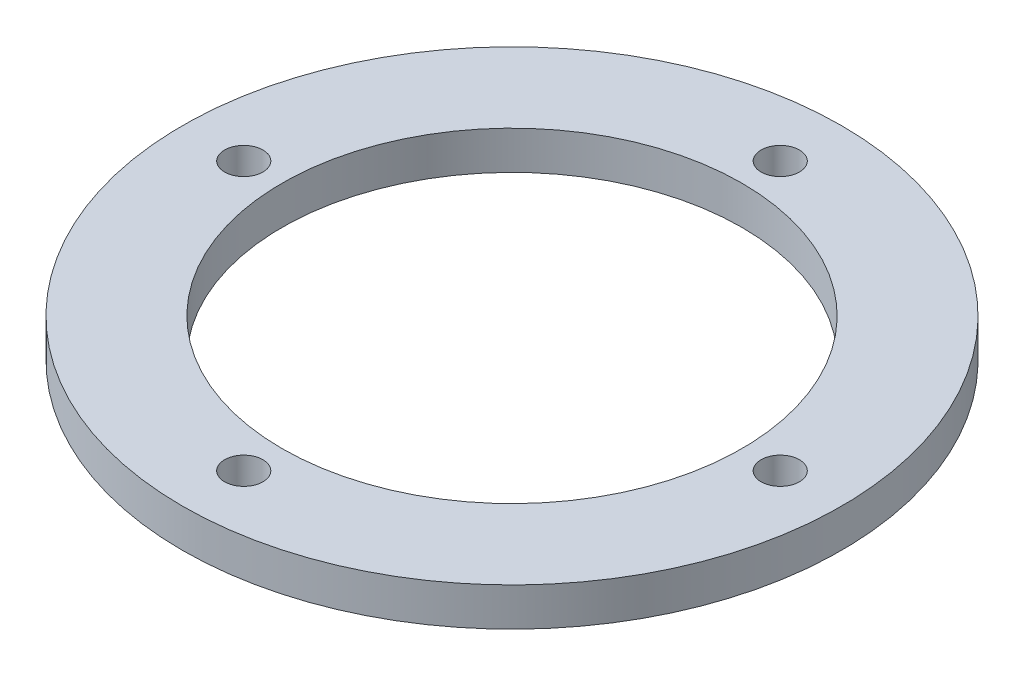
ISO-10303-21;
HEADER;
FILE_DESCRIPTION(('STEP AP214'),'2;1');
FILE_NAME('part.step','',(''),(''),'','','');
FILE_SCHEMA(('AUTOMOTIVE_DESIGN { 1 0 10303 214 1 1 1 1 }'));
ENDSEC;
DATA;
#1=APPLICATION_CONTEXT('core data for automotive mechanical design processes');
#2=APPLICATION_PROTOCOL_DEFINITION('international standard','automotive_design',2000,#1);
#3=PRODUCT_CONTEXT('',#1,'mechanical');
#4=PRODUCT('Part','Part','',(#3));
#5=PRODUCT_RELATED_PRODUCT_CATEGORY('part','',(#4));
#6=PRODUCT_DEFINITION_FORMATION('','',#4);
#7=PRODUCT_DEFINITION_CONTEXT('part definition',#1,'design');
#8=PRODUCT_DEFINITION('design','',#6,#7);
#9=PRODUCT_DEFINITION_SHAPE('','',#8);
#10=(LENGTH_UNIT() NAMED_UNIT(*) SI_UNIT(.MILLI.,.METRE.));
#11=(NAMED_UNIT(*) PLANE_ANGLE_UNIT() SI_UNIT($,.RADIAN.));
#12=(NAMED_UNIT(*) SI_UNIT($,.STERADIAN.) SOLID_ANGLE_UNIT());
#13=UNCERTAINTY_MEASURE_WITH_UNIT(LENGTH_MEASURE(1.E-05),#10,'distance_accuracy_value','');
#14=(GEOMETRIC_REPRESENTATION_CONTEXT(3) GLOBAL_UNCERTAINTY_ASSIGNED_CONTEXT((#13)) GLOBAL_UNIT_ASSIGNED_CONTEXT((#10,
#11,#12)) REPRESENTATION_CONTEXT('',''));
#15=CARTESIAN_POINT('',(0.,0.,0.));
#16=DIRECTION('',(0.,0.,1.));
#17=DIRECTION('',(1.,0.,0.));
#18=AXIS2_PLACEMENT_3D('',#15,#16,#17);
#19=CARTESIAN_POINT('',(0.,5.,0.));
#20=DIRECTION('',(0.,1.,0.));
#21=DIRECTION('',(0.,0.,1.));
#22=AXIS2_PLACEMENT_3D('',#19,#20,#21);
#23=PLANE('',#22);
#24=CARTESIAN_POINT('',(1.97758476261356E-12,5.,35.));
#25=DIRECTION('',(0.,1.,0.));
#26=DIRECTION('',(0.,0.,1.));
#27=AXIS2_PLACEMENT_3D('',#24,#25,#26);
#28=CIRCLE('',#27,2.5);
#29=CARTESIAN_POINT('',(1.97758476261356E-12,5.,37.5));
#30=VERTEX_POINT('',#29);
#31=EDGE_CURVE('E58',#30,#30,#28,.T.);
#32=ORIENTED_EDGE('',*,*,#31,.F.);
#33=EDGE_LOOP('',(#32));
#34=FACE_BOUND('',#33,.T.);
#35=CARTESIAN_POINT('',(0.,5.,-35.));
#36=DIRECTION('',(0.,1.,0.));
#37=DIRECTION('',(0.,0.,1.));
#38=AXIS2_PLACEMENT_3D('',#35,#36,#37);
#39=CIRCLE('',#38,2.5);
#40=CARTESIAN_POINT('',(0.,5.,-32.5));
#41=VERTEX_POINT('',#40);
#42=EDGE_CURVE('E46',#41,#41,#39,.T.);
#43=ORIENTED_EDGE('',*,*,#42,.F.);
#44=EDGE_LOOP('',(#43));
#45=FACE_BOUND('',#44,.T.);
#46=CARTESIAN_POINT('',(0.,5.,0.));
#47=DIRECTION('',(0.,1.,0.));
#48=DIRECTION('',(0.,0.,1.));
#49=AXIS2_PLACEMENT_3D('',#46,#47,#48);
#50=CIRCLE('',#49,43.);
#51=CARTESIAN_POINT('',(0.,5.,43.));
#52=VERTEX_POINT('',#51);
#53=EDGE_CURVE('E10',#52,#52,#50,.T.);
#54=ORIENTED_EDGE('',*,*,#53,.T.);
#55=EDGE_LOOP('',(#54));
#56=FACE_BOUND('',#55,.T.);
#57=CARTESIAN_POINT('',(-34.999999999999,5.,9.86187302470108E-13));
#58=DIRECTION('',(0.,1.,0.));
#59=DIRECTION('',(0.,0.,1.));
#60=AXIS2_PLACEMENT_3D('',#57,#58,#59);
#61=CIRCLE('',#60,2.5);
#62=CARTESIAN_POINT('',(-34.999999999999,5.,2.50000000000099));
#63=VERTEX_POINT('',#62);
#64=EDGE_CURVE('E41',#63,#63,#61,.T.);
#65=ORIENTED_EDGE('',*,*,#64,.F.);
#66=EDGE_LOOP('',(#65));
#67=FACE_BOUND('',#66,.T.);
#68=CARTESIAN_POINT('',(35.000000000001,5.,-9.90527104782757E-13));
#69=DIRECTION('',(0.,1.,0.));
#70=DIRECTION('',(0.,0.,1.));
#71=AXIS2_PLACEMENT_3D('',#68,#69,#70);
#72=CIRCLE('',#71,2.5);
#73=CARTESIAN_POINT('',(35.000000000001,5.,2.49999999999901));
#74=VERTEX_POINT('',#73);
#75=EDGE_CURVE('E52',#74,#74,#72,.T.);
#76=ORIENTED_EDGE('',*,*,#75,.F.);
#77=EDGE_LOOP('',(#76));
#78=FACE_BOUND('',#77,.T.);
#79=CARTESIAN_POINT('',(0.,5.,0.));
#80=DIRECTION('',(0.,1.,0.));
#81=DIRECTION('',(0.,0.,1.));
#82=AXIS2_PLACEMENT_3D('',#79,#80,#81);
#83=CIRCLE('',#82,30.);
#84=CARTESIAN_POINT('',(0.,5.,30.));
#85=VERTEX_POINT('',#84);
#86=EDGE_CURVE('E64',#85,#85,#83,.T.);
#87=ORIENTED_EDGE('',*,*,#86,.F.);
#88=EDGE_LOOP('',(#87));
#89=FACE_BOUND('',#88,.T.);
#90=ADVANCED_FACE('F30',(#34,#45,#56,#67,#78,#89),#23,.T.);
#91=CARTESIAN_POINT('',(0.,0.,0.));
#92=DIRECTION('',(0.,1.,0.));
#93=DIRECTION('',(0.,0.,1.));
#94=AXIS2_PLACEMENT_3D('',#91,#92,#93);
#95=PLANE('',#94);
#96=CARTESIAN_POINT('',(0.,0.,0.));
#97=DIRECTION('',(0.,1.,0.));
#98=DIRECTION('',(0.,0.,1.));
#99=AXIS2_PLACEMENT_3D('',#96,#97,#98);
#100=CIRCLE('',#99,43.);
#101=CARTESIAN_POINT('',(0.,0.,43.));
#102=VERTEX_POINT('',#101);
#103=EDGE_CURVE('E34',#102,#102,#100,.T.);
#104=ORIENTED_EDGE('',*,*,#103,.F.);
#105=EDGE_LOOP('',(#104));
#106=FACE_BOUND('',#105,.T.);
#107=CARTESIAN_POINT('',(-34.999999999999,0.,9.86187302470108E-13));
#108=DIRECTION('',(0.,1.,0.));
#109=DIRECTION('',(0.,0.,1.));
#110=AXIS2_PLACEMENT_3D('',#107,#108,#109);
#111=CIRCLE('',#110,2.5);
#112=CARTESIAN_POINT('',(-34.999999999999,0.,2.50000000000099));
#113=VERTEX_POINT('',#112);
#114=EDGE_CURVE('E43',#113,#113,#111,.T.);
#115=ORIENTED_EDGE('',*,*,#114,.T.);
#116=EDGE_LOOP('',(#115));
#117=FACE_BOUND('',#116,.T.);
#118=CARTESIAN_POINT('',(0.,0.,-35.));
#119=DIRECTION('',(0.,1.,0.));
#120=DIRECTION('',(0.,0.,1.));
#121=AXIS2_PLACEMENT_3D('',#118,#119,#120);
#122=CIRCLE('',#121,2.5);
#123=CARTESIAN_POINT('',(0.,0.,-32.5));
#124=VERTEX_POINT('',#123);
#125=EDGE_CURVE('E49',#124,#124,#122,.T.);
#126=ORIENTED_EDGE('',*,*,#125,.T.);
#127=EDGE_LOOP('',(#126));
#128=FACE_BOUND('',#127,.T.);
#129=CARTESIAN_POINT('',(35.000000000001,0.,-9.90527104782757E-13));
#130=DIRECTION('',(0.,1.,0.));
#131=DIRECTION('',(0.,0.,1.));
#132=AXIS2_PLACEMENT_3D('',#129,#130,#131);
#133=CIRCLE('',#132,2.5);
#134=CARTESIAN_POINT('',(35.000000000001,0.,2.49999999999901));
#135=VERTEX_POINT('',#134);
#136=EDGE_CURVE('E55',#135,#135,#133,.T.);
#137=ORIENTED_EDGE('',*,*,#136,.T.);
#138=EDGE_LOOP('',(#137));
#139=FACE_BOUND('',#138,.T.);
#140=CARTESIAN_POINT('',(1.97758476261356E-12,0.,35.));
#141=DIRECTION('',(0.,1.,0.));
#142=DIRECTION('',(0.,0.,1.));
#143=AXIS2_PLACEMENT_3D('',#140,#141,#142);
#144=CIRCLE('',#143,2.5);
#145=CARTESIAN_POINT('',(1.97758476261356E-12,0.,37.5));
#146=VERTEX_POINT('',#145);
#147=EDGE_CURVE('E61',#146,#146,#144,.T.);
#148=ORIENTED_EDGE('',*,*,#147,.T.);
#149=EDGE_LOOP('',(#148));
#150=FACE_BOUND('',#149,.T.);
#151=CARTESIAN_POINT('',(0.,0.,0.));
#152=DIRECTION('',(0.,1.,0.));
#153=DIRECTION('',(0.,0.,1.));
#154=AXIS2_PLACEMENT_3D('',#151,#152,#153);
#155=CIRCLE('',#154,30.);
#156=CARTESIAN_POINT('',(0.,0.,30.));
#157=VERTEX_POINT('',#156);
#158=EDGE_CURVE('E67',#157,#157,#155,.T.);
#159=ORIENTED_EDGE('',*,*,#158,.T.);
#160=EDGE_LOOP('',(#159));
#161=FACE_BOUND('',#160,.T.);
#162=ADVANCED_FACE('F77',(#106,#117,#128,#139,#150,#161),#95,.F.);
#163=CARTESIAN_POINT('',(0.,5.,0.));
#164=DIRECTION('',(0.,-1.,0.));
#165=DIRECTION('',(0.,0.,-1.));
#166=AXIS2_PLACEMENT_3D('',#163,#164,#165);
#167=CYLINDRICAL_SURFACE('',#166,43.);
#168=ORIENTED_EDGE('',*,*,#53,.F.);
#169=EDGE_LOOP('',(#168));
#170=FACE_BOUND('',#169,.T.);
#171=ORIENTED_EDGE('',*,*,#103,.T.);
#172=EDGE_LOOP('',(#171));
#173=FACE_BOUND('',#172,.T.);
#174=ADVANCED_FACE('F32',(#170,#173),#167,.T.);
#175=CARTESIAN_POINT('',(-34.999999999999,5.,9.86187302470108E-13));
#176=DIRECTION('',(0.,-1.,0.));
#177=DIRECTION('',(0.,0.,-1.));
#178=AXIS2_PLACEMENT_3D('',#175,#176,#177);
#179=CYLINDRICAL_SURFACE('',#178,2.5);
#180=ORIENTED_EDGE('',*,*,#64,.T.);
#181=EDGE_LOOP('',(#180));
#182=FACE_BOUND('',#181,.T.);
#183=ORIENTED_EDGE('',*,*,#114,.F.);
#184=EDGE_LOOP('',(#183));
#185=FACE_BOUND('',#184,.T.);
#186=ADVANCED_FACE('F87',(#182,#185),#179,.F.);
#187=CARTESIAN_POINT('',(0.,5.,-35.));
#188=DIRECTION('',(0.,-1.,0.));
#189=DIRECTION('',(0.,0.,-1.));
#190=AXIS2_PLACEMENT_3D('',#187,#188,#189);
#191=CYLINDRICAL_SURFACE('',#190,2.5);
#192=ORIENTED_EDGE('',*,*,#42,.T.);
#193=EDGE_LOOP('',(#192));
#194=FACE_BOUND('',#193,.T.);
#195=ORIENTED_EDGE('',*,*,#125,.F.);
#196=EDGE_LOOP('',(#195));
#197=FACE_BOUND('',#196,.T.);
#198=ADVANCED_FACE('F90',(#194,#197),#191,.F.);
#199=CARTESIAN_POINT('',(35.000000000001,5.,-9.90527104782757E-13));
#200=DIRECTION('',(0.,-1.,0.));
#201=DIRECTION('',(0.,0.,-1.));
#202=AXIS2_PLACEMENT_3D('',#199,#200,#201);
#203=CYLINDRICAL_SURFACE('',#202,2.5);
#204=ORIENTED_EDGE('',*,*,#75,.T.);
#205=EDGE_LOOP('',(#204));
#206=FACE_BOUND('',#205,.T.);
#207=ORIENTED_EDGE('',*,*,#136,.F.);
#208=EDGE_LOOP('',(#207));
#209=FACE_BOUND('',#208,.T.);
#210=ADVANCED_FACE('F94',(#206,#209),#203,.F.);
#211=CARTESIAN_POINT('',(1.97758476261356E-12,5.,35.));
#212=DIRECTION('',(0.,-1.,0.));
#213=DIRECTION('',(0.,0.,-1.));
#214=AXIS2_PLACEMENT_3D('',#211,#212,#213);
#215=CYLINDRICAL_SURFACE('',#214,2.5);
#216=ORIENTED_EDGE('',*,*,#31,.T.);
#217=EDGE_LOOP('',(#216));
#218=FACE_BOUND('',#217,.T.);
#219=ORIENTED_EDGE('',*,*,#147,.F.);
#220=EDGE_LOOP('',(#219));
#221=FACE_BOUND('',#220,.T.);
#222=ADVANCED_FACE('F98',(#218,#221),#215,.F.);
#223=CARTESIAN_POINT('',(0.,5.,0.));
#224=DIRECTION('',(0.,-1.,0.));
#225=DIRECTION('',(0.,0.,-1.));
#226=AXIS2_PLACEMENT_3D('',#223,#224,#225);
#227=CYLINDRICAL_SURFACE('',#226,30.);
#228=ORIENTED_EDGE('',*,*,#86,.T.);
#229=EDGE_LOOP('',(#228));
#230=FACE_BOUND('',#229,.T.);
#231=ORIENTED_EDGE('',*,*,#158,.F.);
#232=EDGE_LOOP('',(#231));
#233=FACE_BOUND('',#232,.T.);
#234=ADVANCED_FACE('F73',(#230,#233),#227,.F.);
#235=CLOSED_SHELL('',(#90,#162,#174,#186,#198,#210,#222,#234));
#236=MANIFOLD_SOLID_BREP('B2',#235);
#237=ADVANCED_BREP_SHAPE_REPRESENTATION('',(#18,#236),#14);
#238=SHAPE_DEFINITION_REPRESENTATION(#9,#237);
ENDSEC;
END-ISO-10303-21;
